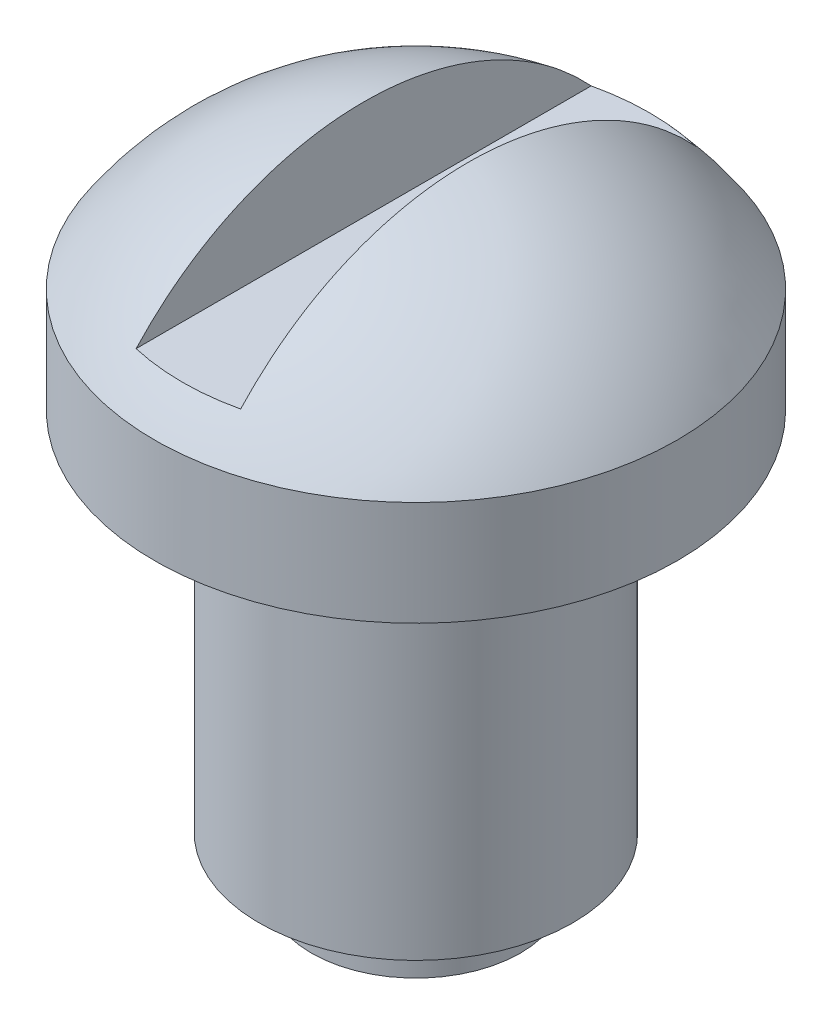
ISO-10303-21;
HEADER;
FILE_DESCRIPTION(('STEP AP214'),'2;1');
FILE_NAME('part.step','',(''),(''),'','','');
FILE_SCHEMA(('AUTOMOTIVE_DESIGN { 1 0 10303 214 1 1 1 1 }'));
ENDSEC;
DATA;
#1=APPLICATION_CONTEXT('core data for automotive mechanical design processes');
#2=APPLICATION_PROTOCOL_DEFINITION('international standard','automotive_design',2000,#1);
#3=PRODUCT_CONTEXT('',#1,'mechanical');
#4=PRODUCT('Part','Part','',(#3));
#5=PRODUCT_RELATED_PRODUCT_CATEGORY('part','',(#4));
#6=PRODUCT_DEFINITION_FORMATION('','',#4);
#7=PRODUCT_DEFINITION_CONTEXT('part definition',#1,'design');
#8=PRODUCT_DEFINITION('design','',#6,#7);
#9=PRODUCT_DEFINITION_SHAPE('','',#8);
#10=(LENGTH_UNIT() NAMED_UNIT(*) SI_UNIT(.MILLI.,.METRE.));
#11=(NAMED_UNIT(*) PLANE_ANGLE_UNIT() SI_UNIT($,.RADIAN.));
#12=(NAMED_UNIT(*) SI_UNIT($,.STERADIAN.) SOLID_ANGLE_UNIT());
#13=UNCERTAINTY_MEASURE_WITH_UNIT(LENGTH_MEASURE(1.E-05),#10,'distance_accuracy_value','');
#14=(GEOMETRIC_REPRESENTATION_CONTEXT(3) GLOBAL_UNCERTAINTY_ASSIGNED_CONTEXT((#13)) GLOBAL_UNIT_ASSIGNED_CONTEXT((#10,
#11,#12)) REPRESENTATION_CONTEXT('',''));
#15=CARTESIAN_POINT('',(0.,0.,0.));
#16=DIRECTION('',(0.,0.,1.));
#17=DIRECTION('',(1.,0.,0.));
#18=AXIS2_PLACEMENT_3D('',#15,#16,#17);
#19=CARTESIAN_POINT('',(0.,6.6833752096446,0.));
#20=DIRECTION('',(0.,-1.,0.));
#21=DIRECTION('',(-1.,0.,0.));
#22=AXIS2_PLACEMENT_3D('',#19,#20,#21);
#23=SPHERICAL_SURFACE('',#22,6.);
#24=CARTESIAN_POINT('',(0.,10.,0.));
#25=DIRECTION('',(0.,-1.,0.));
#26=DIRECTION('',(1.,0.,0.));
#27=AXIS2_PLACEMENT_3D('',#24,#25,#26);
#28=CIRCLE('',#27,5.);
#29=CARTESIAN_POINT('',(5.,10.,0.));
#30=VERTEX_POINT('',#29);
#31=EDGE_CURVE('E83',#30,#30,#28,.T.);
#32=ORIENTED_EDGE('',*,*,#31,.F.);
#33=EDGE_LOOP('',(#32));
#34=FACE_BOUND('',#33,.T.);
#35=CARTESIAN_POINT('',(0.,10.69,0.));
#36=DIRECTION('',(0.,1.,0.));
#37=DIRECTION('',(0.,0.,1.));
#38=AXIS2_PLACEMENT_3D('',#35,#36,#37);
#39=CIRCLE('',#38,4.4662017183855);
#40=CARTESIAN_POINT('',(1.,10.69,-4.35281033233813));
#41=VERTEX_POINT('',#40);
#42=CARTESIAN_POINT('',(-1.,10.69,-4.35281033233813));
#43=VERTEX_POINT('',#42);
#44=EDGE_CURVE('E11',#41,#43,#39,.T.);
#45=ORIENTED_EDGE('',*,*,#44,.F.);
#46=CARTESIAN_POINT('',(1.,6.6833752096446,0.));
#47=DIRECTION('',(1.,0.,0.));
#48=DIRECTION('',(0.,0.,-1.));
#49=AXIS2_PLACEMENT_3D('',#46,#47,#48);
#50=CIRCLE('',#49,5.91607978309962);
#51=CARTESIAN_POINT('',(1.,10.69,4.35281033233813));
#52=VERTEX_POINT('',#51);
#53=EDGE_CURVE('E35',#41,#52,#50,.T.);
#54=ORIENTED_EDGE('',*,*,#53,.T.);
#55=CARTESIAN_POINT('',(-1.,10.69,4.35281033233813));
#56=VERTEX_POINT('',#55);
#57=EDGE_CURVE('E41',#56,#52,#39,.T.);
#58=ORIENTED_EDGE('',*,*,#57,.F.);
#59=CARTESIAN_POINT('',(-1.,6.6833752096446,0.));
#60=DIRECTION('',(-1.,0.,0.));
#61=DIRECTION('',(0.,0.,1.));
#62=AXIS2_PLACEMENT_3D('',#59,#60,#61);
#63=CIRCLE('',#62,5.91607978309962);
#64=EDGE_CURVE('E63',#56,#43,#63,.T.);
#65=ORIENTED_EDGE('',*,*,#64,.T.);
#66=EDGE_LOOP('',(#45,#54,#58,#65));
#67=FACE_BOUND('',#66,.T.);
#68=ADVANCED_FACE('F31',(#34,#67),#23,.T.);
#69=CARTESIAN_POINT('',(0.,0.,0.));
#70=DIRECTION('',(0.,1.,0.));
#71=DIRECTION('',(-1.,0.,0.));
#72=AXIS2_PLACEMENT_3D('',#69,#70,#71);
#73=PLANE('',#72);
#74=CARTESIAN_POINT('',(0.,0.,0.));
#75=DIRECTION('',(0.,-1.,0.));
#76=DIRECTION('',(1.,0.,0.));
#77=AXIS2_PLACEMENT_3D('',#74,#75,#76);
#78=CIRCLE('',#77,2.);
#79=CARTESIAN_POINT('',(2.,0.,0.));
#80=VERTEX_POINT('',#79);
#81=EDGE_CURVE('E64',#80,#80,#78,.T.);
#82=ORIENTED_EDGE('',*,*,#81,.T.);
#83=EDGE_LOOP('',(#82));
#84=FACE_BOUND('',#83,.T.);
#85=ADVANCED_FACE('F33',(#84),#73,.F.);
#86=CARTESIAN_POINT('',(0.,0.,0.));
#87=DIRECTION('',(0.,-1.,0.));
#88=DIRECTION('',(1.,0.,0.));
#89=AXIS2_PLACEMENT_3D('',#86,#87,#88);
#90=CYLINDRICAL_SURFACE('',#89,2.);
#91=ORIENTED_EDGE('',*,*,#81,.F.);
#92=EDGE_LOOP('',(#91));
#93=FACE_BOUND('',#92,.T.);
#94=CARTESIAN_POINT('',(0.,1.,0.));
#95=DIRECTION('',(0.,-1.,0.));
#96=DIRECTION('',(1.,0.,0.));
#97=AXIS2_PLACEMENT_3D('',#94,#95,#96);
#98=CIRCLE('',#97,2.);
#99=CARTESIAN_POINT('',(2.,1.,0.));
#100=VERTEX_POINT('',#99);
#101=EDGE_CURVE('E71',#100,#100,#98,.T.);
#102=ORIENTED_EDGE('',*,*,#101,.T.);
#103=EDGE_LOOP('',(#102));
#104=FACE_BOUND('',#103,.T.);
#105=ADVANCED_FACE('F95',(#93,#104),#90,.T.);
#106=CARTESIAN_POINT('',(-2.,1.,0.));
#107=DIRECTION('',(0.,1.,0.));
#108=DIRECTION('',(-1.,0.,0.));
#109=AXIS2_PLACEMENT_3D('',#106,#107,#108);
#110=PLANE('',#109);
#111=ORIENTED_EDGE('',*,*,#101,.F.);
#112=EDGE_LOOP('',(#111));
#113=FACE_BOUND('',#112,.T.);
#114=CARTESIAN_POINT('',(0.,0.999999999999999,0.));
#115=DIRECTION('',(0.,-1.,0.));
#116=DIRECTION('',(1.,0.,0.));
#117=AXIS2_PLACEMENT_3D('',#114,#115,#116);
#118=CIRCLE('',#117,3.);
#119=CARTESIAN_POINT('',(3.,0.999999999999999,0.));
#120=VERTEX_POINT('',#119);
#121=EDGE_CURVE('E74',#120,#120,#118,.T.);
#122=ORIENTED_EDGE('',*,*,#121,.T.);
#123=EDGE_LOOP('',(#122));
#124=FACE_BOUND('',#123,.T.);
#125=ADVANCED_FACE('F110',(#113,#124),#110,.F.);
#126=CARTESIAN_POINT('',(0.,0.,0.));
#127=DIRECTION('',(0.,-1.,0.));
#128=DIRECTION('',(1.,0.,0.));
#129=AXIS2_PLACEMENT_3D('',#126,#127,#128);
#130=CYLINDRICAL_SURFACE('',#129,3.);
#131=ORIENTED_EDGE('',*,*,#121,.F.);
#132=EDGE_LOOP('',(#131));
#133=FACE_BOUND('',#132,.T.);
#134=CARTESIAN_POINT('',(0.,8.,0.));
#135=DIRECTION('',(0.,-1.,0.));
#136=DIRECTION('',(1.,0.,0.));
#137=AXIS2_PLACEMENT_3D('',#134,#135,#136);
#138=CIRCLE('',#137,3.);
#139=CARTESIAN_POINT('',(3.,8.,0.));
#140=VERTEX_POINT('',#139);
#141=EDGE_CURVE('E77',#140,#140,#138,.T.);
#142=ORIENTED_EDGE('',*,*,#141,.T.);
#143=EDGE_LOOP('',(#142));
#144=FACE_BOUND('',#143,.T.);
#145=ADVANCED_FACE('F106',(#133,#144),#130,.T.);
#146=CARTESIAN_POINT('',(-3.,8.,0.));
#147=DIRECTION('',(0.,1.,0.));
#148=DIRECTION('',(-1.,0.,0.));
#149=AXIS2_PLACEMENT_3D('',#146,#147,#148);
#150=PLANE('',#149);
#151=ORIENTED_EDGE('',*,*,#141,.F.);
#152=EDGE_LOOP('',(#151));
#153=FACE_BOUND('',#152,.T.);
#154=CARTESIAN_POINT('',(0.,8.,0.));
#155=DIRECTION('',(0.,-1.,0.));
#156=DIRECTION('',(1.,0.,0.));
#157=AXIS2_PLACEMENT_3D('',#154,#155,#156);
#158=CIRCLE('',#157,5.);
#159=CARTESIAN_POINT('',(5.,8.,0.));
#160=VERTEX_POINT('',#159);
#161=EDGE_CURVE('E80',#160,#160,#158,.T.);
#162=ORIENTED_EDGE('',*,*,#161,.T.);
#163=EDGE_LOOP('',(#162));
#164=FACE_BOUND('',#163,.T.);
#165=ADVANCED_FACE('F102',(#153,#164),#150,.F.);
#166=CARTESIAN_POINT('',(0.,0.,0.));
#167=DIRECTION('',(0.,-1.,0.));
#168=DIRECTION('',(1.,0.,0.));
#169=AXIS2_PLACEMENT_3D('',#166,#167,#168);
#170=CYLINDRICAL_SURFACE('',#169,5.);
#171=ORIENTED_EDGE('',*,*,#161,.F.);
#172=EDGE_LOOP('',(#171));
#173=FACE_BOUND('',#172,.T.);
#174=ORIENTED_EDGE('',*,*,#31,.T.);
#175=EDGE_LOOP('',(#174));
#176=FACE_BOUND('',#175,.T.);
#177=ADVANCED_FACE('F88',(#173,#176),#170,.T.);
#178=CARTESIAN_POINT('',(1.,10.69,5.35));
#179=DIRECTION('',(1.,0.,0.));
#180=DIRECTION('',(0.,0.,-1.));
#181=AXIS2_PLACEMENT_3D('',#178,#179,#180);
#182=PLANE('',#181);
#183=DIRECTION('',(0.,0.,-1.));
#184=VECTOR('',#183,1.);
#185=CARTESIAN_POINT('',(1.,10.69,5.35));
#186=LINE('',#185,#184);
#187=EDGE_CURVE('E59',#52,#41,#186,.T.);
#188=ORIENTED_EDGE('',*,*,#187,.F.);
#189=ORIENTED_EDGE('',*,*,#53,.F.);
#190=EDGE_LOOP('',(#188,#189));
#191=FACE_BOUND('',#190,.T.);
#192=ADVANCED_FACE('F66',(#191),#182,.F.);
#193=CARTESIAN_POINT('',(-1.,10.69,5.35));
#194=DIRECTION('',(-1.,0.,0.));
#195=DIRECTION('',(0.,0.,1.));
#196=AXIS2_PLACEMENT_3D('',#193,#194,#195);
#197=PLANE('',#196);
#198=DIRECTION('',(0.,0.,1.));
#199=VECTOR('',#198,1.);
#200=CARTESIAN_POINT('',(-1.,10.69,5.35));
#201=LINE('',#200,#199);
#202=EDGE_CURVE('E47',#43,#56,#201,.T.);
#203=ORIENTED_EDGE('',*,*,#202,.F.);
#204=ORIENTED_EDGE('',*,*,#64,.F.);
#205=EDGE_LOOP('',(#203,#204));
#206=FACE_BOUND('',#205,.T.);
#207=ADVANCED_FACE('F151',(#206),#197,.F.);
#208=CARTESIAN_POINT('',(1.,10.69,-5.35));
#209=DIRECTION('',(0.,1.,0.));
#210=DIRECTION('',(0.,0.,1.));
#211=AXIS2_PLACEMENT_3D('',#208,#209,#210);
#212=PLANE('',#211);
#213=ORIENTED_EDGE('',*,*,#44,.T.);
#214=ORIENTED_EDGE('',*,*,#202,.T.);
#215=ORIENTED_EDGE('',*,*,#57,.T.);
#216=ORIENTED_EDGE('',*,*,#187,.T.);
#217=EDGE_LOOP('',(#213,#214,#215,#216));
#218=FACE_BOUND('',#217,.T.);
#219=ADVANCED_FACE('F58',(#218),#212,.T.);
#220=CLOSED_SHELL('',(#68,#85,#105,#125,#145,#165,#177,#192,#207,#219));
#221=MANIFOLD_SOLID_BREP('B2',#220);
#222=ADVANCED_BREP_SHAPE_REPRESENTATION('',(#18,#221),#14);
#223=SHAPE_DEFINITION_REPRESENTATION(#9,#222);
ENDSEC;
END-ISO-10303-21;
